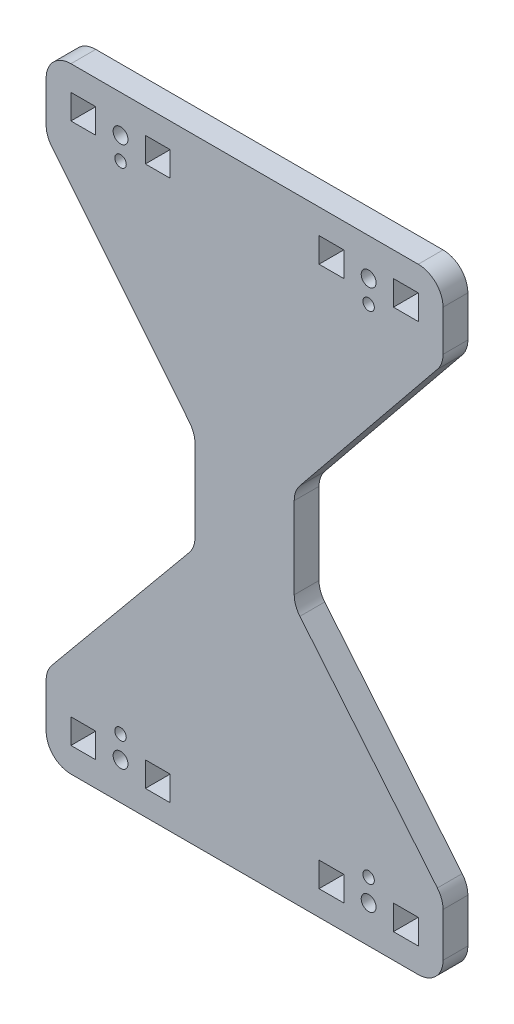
from build123d import *

# Parameters (mm, degrees)
SKETCH1_R           = 1.15
SKETCH1_R_2         = 1.5
SKETCH1_W           = 5
SKETCH1_H           = 5
BOSS_EXTRUDE1_DEPTH = 5
FILLET1_R           = 5


with BuildPart() as part:
    # Sketch1 → Boss-Extrude1 (new body)
    with BuildSketch(Plane.XY):
        Polygon((0, 0), (80, 0), (80, 15.66942074), (50, 52), (50, 72), (80, 109), (80, 124), (0, 124), (0, 109), (30, 72), (30, 52), (0, 15.66942074), align=None)
        with Locations((15, 112)):
            Circle(SKETCH1_R, mode=Mode.SUBTRACT)
        with Locations(Location((65, 112, 0), (0, 0, 180))):
            Circle(SKETCH1_R, mode=Mode.SUBTRACT)
        with Locations(Location((15, 12, 0), (0, 0, 180))):
            Circle(SKETCH1_R, mode=Mode.SUBTRACT)
        with Locations((65, 12)):
            Circle(SKETCH1_R, mode=Mode.SUBTRACT)
        with Locations((65, 7.5)):
            Circle(SKETCH1_R_2, mode=Mode.SUBTRACT)
        with Locations(Location((15, 7.5, 0), (0, 0, 180))):
            Circle(SKETCH1_R_2, mode=Mode.SUBTRACT)
        with Locations(Location((65, 116.5, 0), (0, 0, 90))):
            Circle(SKETCH1_R_2, mode=Mode.SUBTRACT)
        with Locations((15, 116.5)):
            Circle(SKETCH1_R_2, mode=Mode.SUBTRACT)
        with Locations((57.5, 7.5)):
            Rectangle(SKETCH1_W, SKETCH1_H, mode=Mode.SUBTRACT)
        with Locations((72.5, 7.5)):
            Rectangle(SKETCH1_W, SKETCH1_H, mode=Mode.SUBTRACT)
        with Locations((22.5, 7.5)):
            Rectangle(SKETCH1_W, SKETCH1_H, mode=Mode.SUBTRACT)
        with Locations((7.5, 7.5)):
            Rectangle(SKETCH1_W, SKETCH1_H, mode=Mode.SUBTRACT)
        with Locations((57.5, 116.5)):
            Rectangle(SKETCH1_W, SKETCH1_H, mode=Mode.SUBTRACT)
        with Locations((72.5, 116.5)):
            Rectangle(SKETCH1_W, SKETCH1_H, mode=Mode.SUBTRACT)
        with Locations((22.5, 116.5)):
            Rectangle(SKETCH1_W, SKETCH1_H, mode=Mode.SUBTRACT)
        with Locations((7.5, 116.5)):
            Rectangle(SKETCH1_W, SKETCH1_H, mode=Mode.SUBTRACT)
    extrude(amount=BOSS_EXTRUDE1_DEPTH)

    # Fillet1
    fillet1_edges = [part.edges().sort_by_distance(p)[0] for p in [
        (0, 15.66942074, 2.5),
        (30, 52, 2.5),
        (30, 72, 2.5),
        (0, 109, 2.5),
        (0, 124, 2.5),
        (80, 124, 2.5),
        (80, 109, 2.5),
        (50, 72, 2.5),
        (50, 52, 2.5),
        (80, 15.66942074, 2.5),
        (80, 0, 2.5),
        (0, 0, 2.5),
    ]]
    fillet(fillet1_edges, radius=FILLET1_R)


solid = part.part
